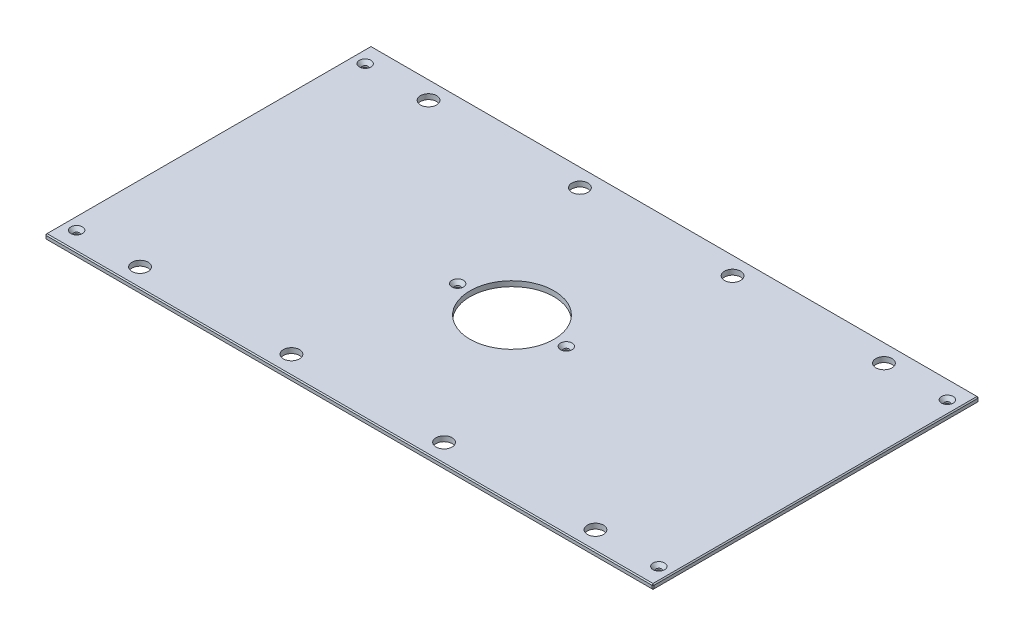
from build123d import *

# Parameters (mm, degrees)
SKETCH1_W                                     = 746.125
SKETCH1_H                                     = 400.05
BOSS_EXTRUDE1_DEPTH                           = 6.35
SKETCH13_R                                    = 51.562
CUT_EXTRUDE6_DEPTH                            = 424.350861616
F_25_32_0_78125_DIAMETER_HOLE1_D              = 19.84375
CHAMFER2_SIZE                                 = 1.27
CSK_FOR_1_4_FLAT_HEAD_MACHINE_SCREW1_AT_COUNT = 2
CSK_FOR_1_4_FLAT_HEAD_MACHINE_SCREW1_AT_PITCH = 354.00996
CSK_FOR_1_4_FLAT_HEAD_MACHINE_SCREW1_2_COUNT  = 2
CSK_FOR_1_4_FLAT_HEAD_MACHINE_SCREW1_2_PITCH  = 797.279557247
CSK_FOR_1_4_FLAT_HEAD_MACHINE_SCREW1_3_COUNT  = 2
CSK_FOR_1_4_FLAT_HEAD_MACHINE_SCREW1_3_PITCH  = 459.336675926
CSK_FOR_1_4_FLAT_HEAD_MACHINE_SCREW1_4_COUNT  = 2
CSK_FOR_1_4_FLAT_HEAD_MACHINE_SCREW1_4_PITCH  = 340.188588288
CSK_FOR_1_4_FLAT_HEAD_MACHINE_SCREW1_5_COUNT  = 2
CSK_FOR_1_4_FLAT_HEAD_MACHINE_SCREW1_5_PITCH  = 714.375
CSK_FOR_1_4_FLAT_HEAD_MACHINE_SCREW1_6_COUNT  = 2
CSK_FOR_1_4_FLAT_HEAD_MACHINE_SCREW1_6_PITCH  = 636.5875
CSK_FOR_1_4_FLAT_HEAD_MACHINE_SCREW1_7_COUNT  = 2
CSK_FOR_1_4_FLAT_HEAD_MACHINE_SCREW1_7_PITCH  = 728.400093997


with BuildPart() as part:
    # Sketch1 → Boss-Extrude1 (new body)
    with BuildSketch(Plane(origin=(0, 0, 0), x_dir=(1, 0, 0), z_dir=(0, 1, 0))):
        Rectangle(SKETCH1_W, SKETCH1_H)
    extrude(amount=BOSS_EXTRUDE1_DEPTH)

    # Sketch13 → Cut-Extrude6 (cut, through all)
    with BuildSketch(Plane(origin=(0, 6.35, 0), x_dir=(1, 0, 0), z_dir=(0, 1, 0))):
        with Locations(Location((0, 0, 0), (0, 0, 270))):
            Circle(SKETCH13_R)
    extrude(amount=-CUT_EXTRUDE6_DEPTH, mode=Mode.SUBTRACT)

    # 25_32 _0.78125_ Diameter Hole1 (through all)
    with Locations(Plane(origin=(0, 6.35, 0), x_dir=(1, 0, 0), z_dir=(0, 1, 0))):
        with Locations((279.4, 177.00498), (-279.4, 177.00498), (279.4, -177.00498), (-279.4, -177.00498), (-93.6625, 177.00498), (93.6625, 177.00498), (93.6625, -177.00498), (-93.6625, -177.00498)):
            Hole(F_25_32_0_78125_DIAMETER_HOLE1_D / 2)

    # Chamfer2
    chamfer2_edges = [part.edges().sort_by_distance(p)[0] for p in [
        (373.0625, 6.35, 0),
        (0, 6.35, -200.025),
        (-373.0625, 6.35, 0),
        (0, 0, -200.025),
        (373.0625, 0, 0),
        (0, 0, 200.025),
        (-373.0625, 0, 0),
        (0, 6.35, 200.025),
        (-373.0625, 3.175, -200.025),
        (373.0625, 3.175, -200.025),
        (373.0625, 3.175, 200.025),
        (-373.0625, 3.175, 200.025),
    ]]
    chamfer(chamfer2_edges, length=CHAMFER2_SIZE)

    # Sketch24 → CSK for 1_4 Flat Head Machine Screw1 (revolve, cut)
    with BuildSketch(Plane(origin=(357.1875, 6.35, -177.00498), x_dir=(0, 0, 1), z_dir=(1, 0, 0))):
        Polygon((0, 0), (0, 6.35), (3.3782, 6.35), (3.3782, 4.324464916), (7.1374, 0), align=None)
    csk_for_1_4_flat_head_machine_screw1 = revolve(axis=Axis((357.1875, 12.7, -177.00498), (0, -1, 0)), mode=Mode.SUBTRACT)

    # CSK for 1_4 Flat Head Machine Screw1 at: CSK for 1_4 Flat Head Machine Screw1 ×2
    with Locations(*[(0, 0, i * CSK_FOR_1_4_FLAT_HEAD_MACHINE_SCREW1_AT_PITCH) for i in range(1, CSK_FOR_1_4_FLAT_HEAD_MACHINE_SCREW1_AT_COUNT)]):
        add(csk_for_1_4_flat_head_machine_screw1, mode=Mode.SUBTRACT)

    # CSK for 1_4 Flat Head Machine Screw1 2: CSK for 1_4 Flat Head Machine Screw1 ×2
    with Locations(*[Vector(-0.8960156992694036, 0, 0.4440223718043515) * (i * CSK_FOR_1_4_FLAT_HEAD_MACHINE_SCREW1_2_PITCH) for i in range(1, CSK_FOR_1_4_FLAT_HEAD_MACHINE_SCREW1_2_COUNT)]):
        add(csk_for_1_4_flat_head_machine_screw1, mode=Mode.SUBTRACT)

    # CSK for 1_4 Flat Head Machine Screw1 3: CSK for 1_4 Flat Head Machine Screw1 ×2
    with Locations(*[Vector(-0.9227708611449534, 0, 0.3853491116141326) * (i * CSK_FOR_1_4_FLAT_HEAD_MACHINE_SCREW1_3_PITCH) for i in range(1, CSK_FOR_1_4_FLAT_HEAD_MACHINE_SCREW1_3_COUNT)]):
        add(csk_for_1_4_flat_head_machine_screw1, mode=Mode.SUBTRACT)

    # CSK for 1_4 Flat Head Machine Screw1 4: CSK for 1_4 Flat Head Machine Screw1 ×2
    with Locations(*[Vector(-0.8539748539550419, 0, 0.5203142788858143) * (i * CSK_FOR_1_4_FLAT_HEAD_MACHINE_SCREW1_4_PITCH) for i in range(1, CSK_FOR_1_4_FLAT_HEAD_MACHINE_SCREW1_4_COUNT)]):
        add(csk_for_1_4_flat_head_machine_screw1, mode=Mode.SUBTRACT)

    # CSK for 1_4 Flat Head Machine Screw1 5: CSK for 1_4 Flat Head Machine Screw1 ×2
    with Locations(*[(-i * CSK_FOR_1_4_FLAT_HEAD_MACHINE_SCREW1_5_PITCH, 0, 0) for i in range(1, CSK_FOR_1_4_FLAT_HEAD_MACHINE_SCREW1_5_COUNT)]):
        add(csk_for_1_4_flat_head_machine_screw1, mode=Mode.SUBTRACT)

    # CSK for 1_4 Flat Head Machine Screw1 6: CSK for 1_4 Flat Head Machine Screw1 ×2
    with Locations(*[(-i * CSK_FOR_1_4_FLAT_HEAD_MACHINE_SCREW1_6_PITCH, 0, 0) for i in range(1, CSK_FOR_1_4_FLAT_HEAD_MACHINE_SCREW1_6_COUNT)]):
        add(csk_for_1_4_flat_head_machine_screw1, mode=Mode.SUBTRACT)

    # CSK for 1_4 Flat Head Machine Screw1 7: CSK for 1_4 Flat Head Machine Screw1 ×2
    with Locations(*[Vector(-0.8739530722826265, 0, 0.48601031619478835) * (i * CSK_FOR_1_4_FLAT_HEAD_MACHINE_SCREW1_7_PITCH) for i in range(1, CSK_FOR_1_4_FLAT_HEAD_MACHINE_SCREW1_7_COUNT)]):
        add(csk_for_1_4_flat_head_machine_screw1, mode=Mode.SUBTRACT)


solid = part.part
